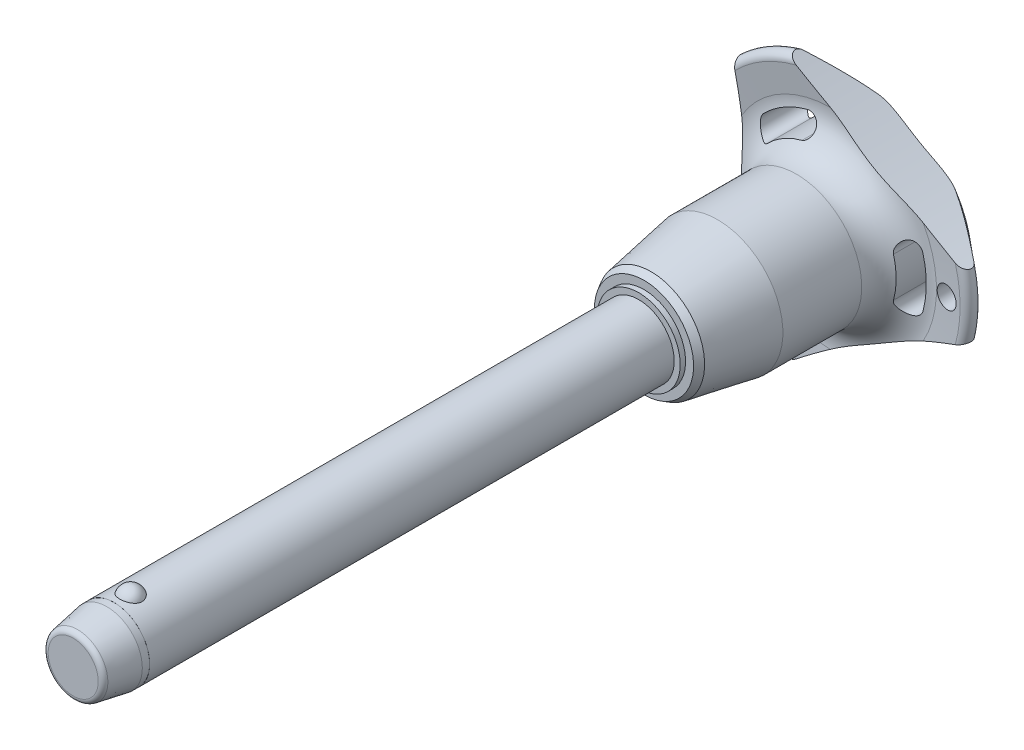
from build123d import *

# Parameters (mm, degrees)
SKETCH1_R           = 5
BOSS_EXTRUDE1_DEPTH = 70
SKETCH2_R           = 4.25
BOSS_EXTRUDE2_DEPTH = 33.3
BOSS_EXTRUDE3_START = 9.6
SKETCH1_2_R         = 5
BOSS_EXTRUDE3_DEPTH = 9.6
CHAMFER1_SIZE       = 4.8
CHAMFER1_SIZE2      = 0.846369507
FILLET1_R           = 0.75
SKETCH6_R           = 102.8
CUT_EXTRUDE1_DEPTH  = 107.957722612
CIRPATTERN1_COUNT   = 3
SKETCH7_R           = 1.5
CUT_EXTRUDE2_DEPTH  = 107.806398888
SKETCH8_R           = 5
SKETCH8_R_2         = 4.99
CUT_EXTRUDE3_DEPTH  = 5.76


with BuildPart() as part:
    # Sketch1 → Boss-Extrude1 (new body)
    with BuildSketch(Plane.XY):
        Circle(SKETCH1_R)
    extrude(amount=-BOSS_EXTRUDE1_DEPTH)

    # Sketch2 → Boss-Extrude2 (add)
    with BuildSketch(Plane(origin=(0, 0, -70), x_dir=(-1, 0, 0), z_dir=(0, 0, -1))):
        Circle(SKETCH2_R)
    extrude(amount=BOSS_EXTRUDE2_DEPTH)

    # Sketch3 → Revolve1 (revolve)
    with BuildSketch(Plane(origin=(0, 0, 0), x_dir=(0, 0, -1), z_dir=(1, 0, 0))):
        with BuildLine():
            Line((-1.516575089, 6), (-1.516575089, 2.7))
            ThreePointArc((-1.516575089, 2.7), (0.133424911, 4.35), (-1.516575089, 6))
        make_face()
        with BuildLine():
            Line((-1.516575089, -2.7), (-1.516575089, -6))
            ThreePointArc((-1.516575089, -6), (0.133424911, -4.35), (-1.516575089, -2.7))
        make_face()
    revolve(axis=Axis((0, -2.7, 1.516575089), (0, 1, 0)))

    # Sketch1_2 → Boss-Extrude3 (add)
    with BuildSketch(Plane.XY.offset(BOSS_EXTRUDE3_START)):
        Circle(SKETCH1_2_R)
    extrude(amount=-BOSS_EXTRUDE3_DEPTH)

    # Chamfer1
    chamfer1_edges = [part.edges().sort_by_distance(p)[0] for p in [
        (-5, 0, 9.6),
    ]]
    chamfer1_side = [part.faces().sort_by_distance(p)[0] for p in [
        (-5, 0, -30.2),
    ]]
    chamfer(chamfer1_edges, length=CHAMFER1_SIZE, length2=CHAMFER1_SIZE2, reference=chamfer1_side[0])

    # Fillet1
    fillet1_edges = [part.edges().sort_by_distance(p)[0] for p in [
        (-4.153630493, 0, 9.6),
        (4.25, 0, -103.3),
    ]]
    fillet(fillet1_edges, radius=FILLET1_R)

    # Sketch4 → Revolve2 (revolve)
    with BuildSketch(Plane(origin=(0, 0, 0), x_dir=(0, 0, -1), z_dir=(1, 0, 0)), mode=Mode.PRIVATE) as revolve2_sk:
        Polygon((70, 0), (70, 5.848880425), (70.75, 5.848880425), (70.75, 6.981619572), (71.730980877, 7.547989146), (81.1, 9.2), (92.2, 9.2), (92.2, 0), align=None)
    revolve(revolve2_sk.sketch.rotate(Axis((0, 0, -92.2), (0, 0, 1)), 90), axis=Axis((0, 0, -92.2), (0, 0, 1)))

    # Sketch5 → Revolve3 (revolve)
    with BuildSketch(Plane(origin=(0, 0, 0), x_dir=(0, 0, -1), z_dir=(1, 0, 0)), mode=Mode.PRIVATE) as revolve3_sk:
        with BuildLine():
            Line((97.169704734, 14.749576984), (96.756059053, 18.490084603))
            ThreePointArc((96.756059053, 18.490084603), (97.35677658, 19.519442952), (98.516044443, 19.24278761))
            Line((98.516044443, 19.24278761), (102.835691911, 14.094832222))
            ThreePointArc((102.835691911, 14.094832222), (103.3, 12.689260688), (102.67067517, 11.349423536))
            ThreePointArc((102.67067517, 11.349423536), (99.033110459, 6.185112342), (97.75, 0))
            Line((97.75, 0), (92.2, 0))
            Line((92.2, 0), (92.2, 9.2))
            ThreePointArc((92.2, 9.2), (95.924774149, 10.864425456), (97.169704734, 14.749576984))
        make_face()
    revolve(revolve3_sk.sketch.rotate(Axis((0, 0, -97.75), (0, 0, 1)), 90), axis=Axis((0, 0, -97.75), (0, 0, 1)))

    # Sketch6 → Cut-Extrude1 (cut, through all)
    with BuildSketch(Plane.XY):
        with Locations((-115.2, 0)):
            Circle(SKETCH6_R)
        with BuildLine():
            ThreePointArc((12.885043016, -3.538869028), (13.362182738, 0), (12.885043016, 3.538869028))
            ThreePointArc((12.885043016, 3.538869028), (11.179749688, 4.509281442), (10.209337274, 2.803988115))
            ThreePointArc((10.209337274, 2.803988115), (10.587394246, 0), (10.209337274, -2.803988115))
            ThreePointArc((10.209337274, -2.803988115), (11.179749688, -4.509281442), (12.885043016, -3.538869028))
        make_face()
    cut_extrude1 = extrude(amount=-CUT_EXTRUDE1_DEPTH, mode=Mode.SUBTRACT)

    # CirPattern1: Cut-Extrude1 ×3 about axis
    cirpattern1_axis = Axis((0, 0, 0), (0, 0, 1))
    for i in range(1, CIRPATTERN1_COUNT):
        add(cut_extrude1.rotate(cirpattern1_axis, i * 360 / CIRPATTERN1_COUNT), mode=Mode.SUBTRACT)

    # Sketch7 → Cut-Extrude2 (cut, through all)
    with BuildSketch(Plane.XY):
        with Locations(Location((16.362182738, 0, 0), (0, 0, 225.449470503))):
            Circle(SKETCH7_R)
    extrude(amount=-CUT_EXTRUDE2_DEPTH, mode=Mode.SUBTRACT)

    # Sketch8 → Cut-Extrude3 (cut)
    with BuildSketch(Plane.XY.offset(9.6)):
        Circle(SKETCH8_R)
        Circle(SKETCH8_R_2, mode=Mode.SUBTRACT)
    extrude(amount=-CUT_EXTRUDE3_DEPTH, mode=Mode.SUBTRACT)


solid = part.part
